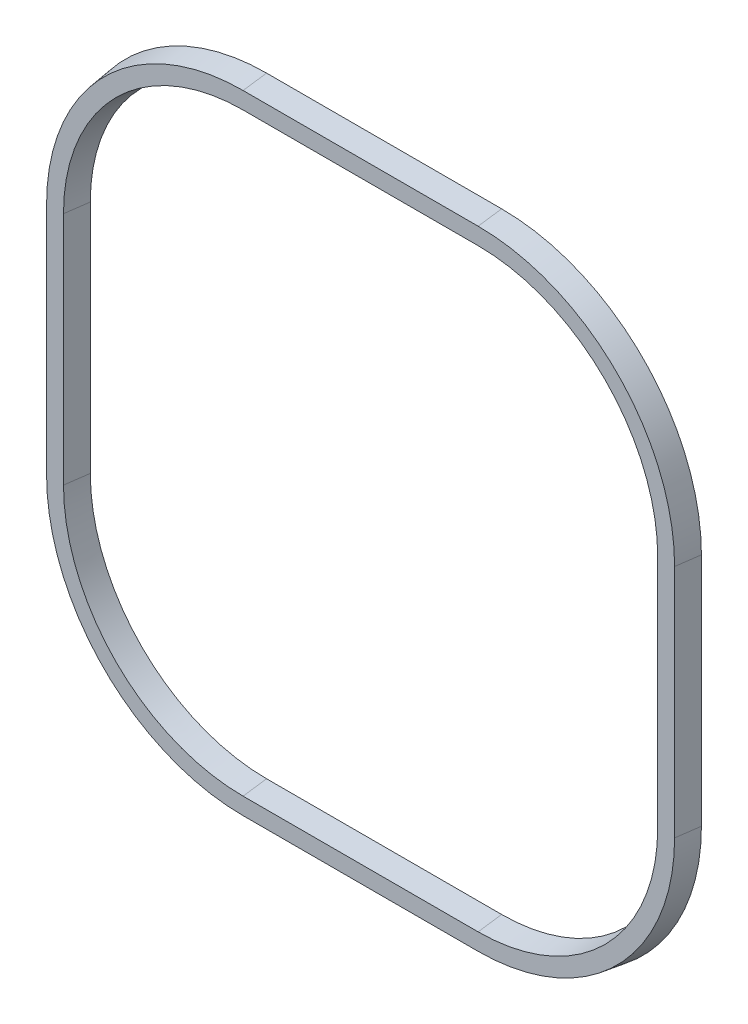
from build123d import *

# Parameters (mm, degrees)
BOSS_EXTRUDE1_DEPTH = 2
BOSS_EXTRUDE1_DRAFT = 8


with BuildPart() as part:
    # Sketch1 → Boss-Extrude1 (with draft: the straight prism first)
    with BuildSketch(Plane.XY):
        with BuildLine():
            Line((43.075, 62), (23.075, 62))
            ThreePointArc((23.075, 62), (11.05418472, 57.02081528), (6.075, 45))
            Line((6.075, 45), (6.075, 25))
            ThreePointArc((6.075, 25), (11.05418472, 12.97918472), (23.075, 8))
            Line((23.075, 8), (43.075, 8))
            ThreePointArc((43.075, 8), (55.09581528, 12.97918472), (60.075, 25))
            Line((60.075, 25), (60.075, 45))
            ThreePointArc((60.075, 45), (55.09581528, 57.02081528), (43.075, 62))
        make_face()
        with BuildLine():
            Line((23.075, 10), (43.075, 10))
            ThreePointArc((43.075, 10), (53.681601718, 14.393398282), (58.075, 25))
            Line((58.075, 25), (58.075, 45))
            ThreePointArc((58.075, 45), (53.681601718, 55.606601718), (43.075, 60))
            Line((43.075, 60), (23.075, 60))
            ThreePointArc((23.075, 60), (12.468398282, 55.606601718), (8.075, 45))
            Line((8.075, 45), (8.075, 25))
            ThreePointArc((8.075, 25), (12.468398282, 14.393398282), (23.075, 10))
        make_face(mode=Mode.SUBTRACT)
    extrude(amount=BOSS_EXTRUDE1_DEPTH)
    # Boss-Extrude1: the draft: its side faces are tilted about the plane it starts from
    boss_extrude1_sides = [part.faces().sort_by_distance(p)[0] for p in [
        (33.075, 62, 1),
        (11.05418472, 57.02081528, 1),
        (6.075, 35, 1),
        (11.05418472, 12.97918472, 1),
        (33.075, 8, 1),
        (55.09581528, 12.97918472, 1),
        (60.075, 35, 1),
        (55.09581528, 57.02081528, 1),
        (8.075, 35, 1),
        (12.468398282, 55.606601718, 1),
        (33.075, 60, 1),
        (53.681601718, 55.606601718, 1),
        (58.075, 35, 1),
        (53.681601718, 14.393398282, 1),
        (33.075, 10, 1),
        (12.468398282, 14.393398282, 1),
    ]]
    draft(boss_extrude1_sides, Plane.XY, BOSS_EXTRUDE1_DRAFT)


solid = part.part
